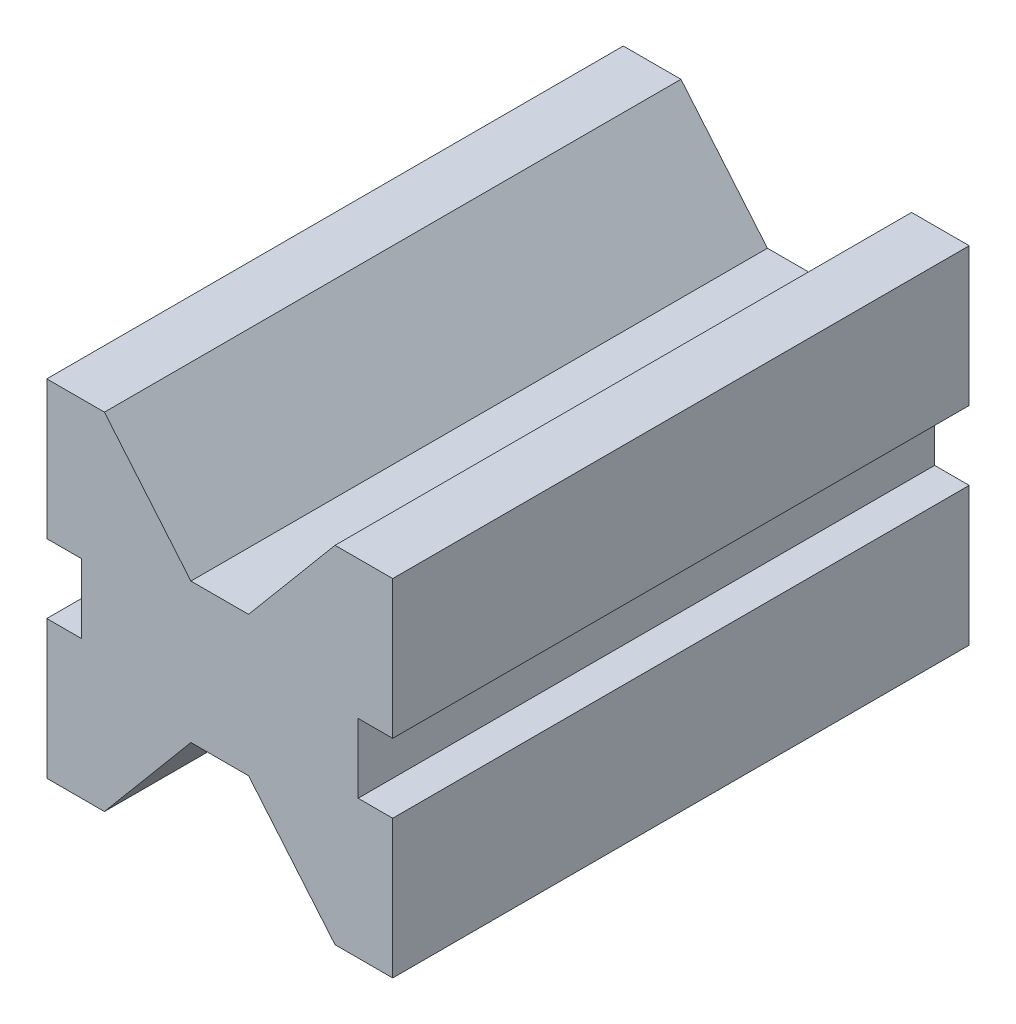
ISO-10303-21;
HEADER;
FILE_DESCRIPTION(('STEP AP214'),'2;1');
FILE_NAME('part.step','',(''),(''),'','','');
FILE_SCHEMA(('AUTOMOTIVE_DESIGN { 1 0 10303 214 1 1 1 1 }'));
ENDSEC;
DATA;
#1=APPLICATION_CONTEXT('core data for automotive mechanical design processes');
#2=APPLICATION_PROTOCOL_DEFINITION('international standard','automotive_design',2000,#1);
#3=PRODUCT_CONTEXT('',#1,'mechanical');
#4=PRODUCT('Part','Part','',(#3));
#5=PRODUCT_RELATED_PRODUCT_CATEGORY('part','',(#4));
#6=PRODUCT_DEFINITION_FORMATION('','',#4);
#7=PRODUCT_DEFINITION_CONTEXT('part definition',#1,'design');
#8=PRODUCT_DEFINITION('design','',#6,#7);
#9=PRODUCT_DEFINITION_SHAPE('','',#8);
#10=(LENGTH_UNIT() NAMED_UNIT(*) SI_UNIT(.MILLI.,.METRE.));
#11=(NAMED_UNIT(*) PLANE_ANGLE_UNIT() SI_UNIT($,.RADIAN.));
#12=(NAMED_UNIT(*) SI_UNIT($,.STERADIAN.) SOLID_ANGLE_UNIT());
#13=UNCERTAINTY_MEASURE_WITH_UNIT(LENGTH_MEASURE(1.E-05),#10,'distance_accuracy_value','');
#14=(GEOMETRIC_REPRESENTATION_CONTEXT(3) GLOBAL_UNCERTAINTY_ASSIGNED_CONTEXT((#13)) GLOBAL_UNIT_ASSIGNED_CONTEXT((#10,
#11,#12)) REPRESENTATION_CONTEXT('',''));
#15=CARTESIAN_POINT('',(0.,0.,0.));
#16=DIRECTION('',(0.,0.,1.));
#17=DIRECTION('',(1.,0.,0.));
#18=AXIS2_PLACEMENT_3D('',#15,#16,#17);
#19=CARTESIAN_POINT('',(-60.,0.,-100.));
#20=DIRECTION('',(-1.,0.,0.));
#21=DIRECTION('',(0.,0.,1.));
#22=AXIS2_PLACEMENT_3D('',#19,#20,#21);
#23=PLANE('',#22);
#24=DIRECTION('',(0.,0.,1.));
#25=VECTOR('',#24,1.);
#26=CARTESIAN_POINT('',(-60.,36.,-143.812809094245));
#27=LINE('',#26,#25);
#28=CARTESIAN_POINT('',(-60.,36.,-100.));
#29=VERTEX_POINT('',#28);
#30=CARTESIAN_POINT('',(-60.,36.,0.));
#31=VERTEX_POINT('',#30);
#32=EDGE_CURVE('E175',#29,#31,#27,.T.);
#33=ORIENTED_EDGE('',*,*,#32,.T.);
#34=DIRECTION('',(0.,-1.,0.));
#35=VECTOR('',#34,1.);
#36=CARTESIAN_POINT('',(-60.,0.,0.));
#37=LINE('',#36,#35);
#38=CARTESIAN_POINT('',(-60.,60.,0.));
#39=VERTEX_POINT('',#38);
#40=EDGE_CURVE('E189',#39,#31,#37,.T.);
#41=ORIENTED_EDGE('',*,*,#40,.F.);
#42=DIRECTION('',(0.,0.,1.));
#43=VECTOR('',#42,1.);
#44=CARTESIAN_POINT('',(-60.,60.,-100.));
#45=LINE('',#44,#43);
#46=CARTESIAN_POINT('',(-60.,60.,-100.));
#47=VERTEX_POINT('',#46);
#48=EDGE_CURVE('E211',#47,#39,#45,.T.);
#49=ORIENTED_EDGE('',*,*,#48,.F.);
#50=DIRECTION('',(0.,-1.,0.));
#51=VECTOR('',#50,1.);
#52=CARTESIAN_POINT('',(-60.,0.,-100.));
#53=LINE('',#52,#51);
#54=EDGE_CURVE('E191',#47,#29,#53,.T.);
#55=ORIENTED_EDGE('',*,*,#54,.T.);
#56=EDGE_LOOP('',(#33,#41,#49,#55));
#57=FACE_BOUND('',#56,.T.);
#58=ADVANCED_FACE('F32',(#57),#23,.T.);
#59=CARTESIAN_POINT('',(0.,0.,-100.));
#60=DIRECTION('',(1.,0.,0.));
#61=DIRECTION('',(0.,0.,-1.));
#62=AXIS2_PLACEMENT_3D('',#59,#60,#61);
#63=PLANE('',#62);
#64=DIRECTION('',(0.,0.,1.));
#65=VECTOR('',#64,1.);
#66=CARTESIAN_POINT('',(0.,24.,-143.812809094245));
#67=LINE('',#66,#65);
#68=CARTESIAN_POINT('',(0.,24.,-100.));
#69=VERTEX_POINT('',#68);
#70=CARTESIAN_POINT('',(0.,24.,0.));
#71=VERTEX_POINT('',#70);
#72=EDGE_CURVE('E294',#69,#71,#67,.T.);
#73=ORIENTED_EDGE('',*,*,#72,.T.);
#74=DIRECTION('',(0.,1.,0.));
#75=VECTOR('',#74,1.);
#76=CARTESIAN_POINT('',(0.,0.,0.));
#77=LINE('',#76,#75);
#78=CARTESIAN_POINT('',(0.,0.,0.));
#79=VERTEX_POINT('',#78);
#80=EDGE_CURVE('E228',#79,#71,#77,.T.);
#81=ORIENTED_EDGE('',*,*,#80,.F.);
#82=DIRECTION('',(0.,0.,1.));
#83=VECTOR('',#82,1.);
#84=CARTESIAN_POINT('',(0.,0.,-100.));
#85=LINE('',#84,#83);
#86=CARTESIAN_POINT('',(0.,0.,-100.));
#87=VERTEX_POINT('',#86);
#88=EDGE_CURVE('E11',#87,#79,#85,.T.);
#89=ORIENTED_EDGE('',*,*,#88,.F.);
#90=DIRECTION('',(0.,1.,0.));
#91=VECTOR('',#90,1.);
#92=CARTESIAN_POINT('',(0.,0.,-100.));
#93=LINE('',#92,#91);
#94=EDGE_CURVE('E248',#87,#69,#93,.T.);
#95=ORIENTED_EDGE('',*,*,#94,.T.);
#96=EDGE_LOOP('',(#73,#81,#89,#95));
#97=FACE_BOUND('',#96,.T.);
#98=ADVANCED_FACE('F356',(#97),#63,.T.);
#99=CARTESIAN_POINT('',(0.,60.,-100.));
#100=DIRECTION('',(0.,1.,0.));
#101=DIRECTION('',(-1.,0.,0.));
#102=AXIS2_PLACEMENT_3D('',#99,#100,#101);
#103=PLANE('',#102);
#104=DIRECTION('',(0.,0.,1.));
#105=VECTOR('',#104,1.);
#106=CARTESIAN_POINT('',(-10.,60.,-143.812809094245));
#107=LINE('',#106,#105);
#108=CARTESIAN_POINT('',(-9.99999999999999,60.,-100.));
#109=VERTEX_POINT('',#108);
#110=CARTESIAN_POINT('',(-10.,60.,0.));
#111=VERTEX_POINT('',#110);
#112=EDGE_CURVE('E316',#109,#111,#107,.T.);
#113=ORIENTED_EDGE('',*,*,#112,.T.);
#114=DIRECTION('',(-1.,0.,0.));
#115=VECTOR('',#114,1.);
#116=CARTESIAN_POINT('',(0.,60.,0.));
#117=LINE('',#116,#115);
#118=CARTESIAN_POINT('',(0.,60.,0.));
#119=VERTEX_POINT('',#118);
#120=EDGE_CURVE('E204',#119,#111,#117,.T.);
#121=ORIENTED_EDGE('',*,*,#120,.F.);
#122=DIRECTION('',(0.,0.,1.));
#123=VECTOR('',#122,1.);
#124=CARTESIAN_POINT('',(0.,60.,-100.));
#125=LINE('',#124,#123);
#126=CARTESIAN_POINT('',(0.,60.,-100.));
#127=VERTEX_POINT('',#126);
#128=EDGE_CURVE('E36',#127,#119,#125,.T.);
#129=ORIENTED_EDGE('',*,*,#128,.F.);
#130=DIRECTION('',(-1.,0.,0.));
#131=VECTOR('',#130,1.);
#132=CARTESIAN_POINT('',(0.,60.,-100.));
#133=LINE('',#132,#131);
#134=EDGE_CURVE('E251',#127,#109,#133,.T.);
#135=ORIENTED_EDGE('',*,*,#134,.T.);
#136=EDGE_LOOP('',(#113,#121,#129,#135));
#137=FACE_BOUND('',#136,.T.);
#138=ADVANCED_FACE('F379',(#137),#103,.T.);
#139=CARTESIAN_POINT('',(0.,0.,-100.));
#140=DIRECTION('',(0.,-1.,0.));
#141=DIRECTION('',(1.,0.,0.));
#142=AXIS2_PLACEMENT_3D('',#139,#140,#141);
#143=PLANE('',#142);
#144=DIRECTION('',(0.,0.,1.));
#145=VECTOR('',#144,1.);
#146=CARTESIAN_POINT('',(-10.,0.,-143.812809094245));
#147=LINE('',#146,#145);
#148=CARTESIAN_POINT('',(-9.99999999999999,0.,-100.));
#149=VERTEX_POINT('',#148);
#150=CARTESIAN_POINT('',(-10.,0.,0.));
#151=VERTEX_POINT('',#150);
#152=EDGE_CURVE('E322',#149,#151,#147,.T.);
#153=ORIENTED_EDGE('',*,*,#152,.F.);
#154=DIRECTION('',(1.,0.,0.));
#155=VECTOR('',#154,1.);
#156=CARTESIAN_POINT('',(0.,0.,-100.));
#157=LINE('',#156,#155);
#158=EDGE_CURVE('E220',#149,#87,#157,.T.);
#159=ORIENTED_EDGE('',*,*,#158,.T.);
#160=ORIENTED_EDGE('',*,*,#88,.T.);
#161=DIRECTION('',(1.,0.,0.));
#162=VECTOR('',#161,1.);
#163=CARTESIAN_POINT('',(0.,0.,0.));
#164=LINE('',#163,#162);
#165=EDGE_CURVE('E199',#151,#79,#164,.T.);
#166=ORIENTED_EDGE('',*,*,#165,.F.);
#167=EDGE_LOOP('',(#153,#159,#160,#166));
#168=FACE_BOUND('',#167,.T.);
#169=ADVANCED_FACE('F353',(#168),#143,.T.);
#170=DIRECTION('',(0.,0.,1.));
#171=VECTOR('',#170,1.);
#172=CARTESIAN_POINT('',(0.,36.,-143.812809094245));
#173=LINE('',#172,#171);
#174=CARTESIAN_POINT('',(0.,36.,-100.));
#175=VERTEX_POINT('',#174);
#176=CARTESIAN_POINT('',(0.,36.,0.));
#177=VERTEX_POINT('',#176);
#178=EDGE_CURVE('E57',#175,#177,#173,.T.);
#179=ORIENTED_EDGE('',*,*,#178,.F.);
#180=EDGE_CURVE('E208',#175,#127,#93,.T.);
#181=ORIENTED_EDGE('',*,*,#180,.T.);
#182=ORIENTED_EDGE('',*,*,#128,.T.);
#183=EDGE_CURVE('E230',#177,#119,#77,.T.);
#184=ORIENTED_EDGE('',*,*,#183,.F.);
#185=EDGE_LOOP('',(#179,#181,#182,#184));
#186=FACE_BOUND('',#185,.T.);
#187=ADVANCED_FACE('F34',(#186),#63,.T.);
#188=DIRECTION('',(0.,0.,1.));
#189=VECTOR('',#188,1.);
#190=CARTESIAN_POINT('',(-50.,0.,-143.812809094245));
#191=LINE('',#190,#189);
#192=CARTESIAN_POINT('',(-50.,0.,-100.));
#193=VERTEX_POINT('',#192);
#194=CARTESIAN_POINT('',(-50.,0.,0.));
#195=VERTEX_POINT('',#194);
#196=EDGE_CURVE('E331',#193,#195,#191,.T.);
#197=ORIENTED_EDGE('',*,*,#196,.T.);
#198=CARTESIAN_POINT('',(-60.,0.,0.));
#199=VERTEX_POINT('',#198);
#200=EDGE_CURVE('E202',#199,#195,#164,.T.);
#201=ORIENTED_EDGE('',*,*,#200,.F.);
#202=DIRECTION('',(0.,0.,1.));
#203=VECTOR('',#202,1.);
#204=CARTESIAN_POINT('',(-60.,0.,-100.));
#205=LINE('',#204,#203);
#206=CARTESIAN_POINT('',(-60.,0.,-100.));
#207=VERTEX_POINT('',#206);
#208=EDGE_CURVE('E41',#207,#199,#205,.T.);
#209=ORIENTED_EDGE('',*,*,#208,.F.);
#210=EDGE_CURVE('E214',#207,#193,#157,.T.);
#211=ORIENTED_EDGE('',*,*,#210,.T.);
#212=EDGE_LOOP('',(#197,#201,#209,#211));
#213=FACE_BOUND('',#212,.T.);
#214=ADVANCED_FACE('F344',(#213),#143,.T.);
#215=DIRECTION('',(0.,0.,1.));
#216=VECTOR('',#215,1.);
#217=CARTESIAN_POINT('',(-60.,24.,-143.812809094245));
#218=LINE('',#217,#216);
#219=CARTESIAN_POINT('',(-60.,24.,-100.));
#220=VERTEX_POINT('',#219);
#221=CARTESIAN_POINT('',(-60.,24.,0.));
#222=VERTEX_POINT('',#221);
#223=EDGE_CURVE('E49',#220,#222,#218,.T.);
#224=ORIENTED_EDGE('',*,*,#223,.F.);
#225=EDGE_CURVE('E253',#220,#207,#53,.T.);
#226=ORIENTED_EDGE('',*,*,#225,.T.);
#227=ORIENTED_EDGE('',*,*,#208,.T.);
#228=EDGE_CURVE('E200',#222,#199,#37,.T.);
#229=ORIENTED_EDGE('',*,*,#228,.F.);
#230=EDGE_LOOP('',(#224,#226,#227,#229));
#231=FACE_BOUND('',#230,.T.);
#232=ADVANCED_FACE('F388',(#231),#23,.T.);
#233=DIRECTION('',(0.,0.,1.));
#234=VECTOR('',#233,1.);
#235=CARTESIAN_POINT('',(-50.,60.,-143.812809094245));
#236=LINE('',#235,#234);
#237=CARTESIAN_POINT('',(-50.,60.,-100.));
#238=VERTEX_POINT('',#237);
#239=CARTESIAN_POINT('',(-50.,60.,0.));
#240=VERTEX_POINT('',#239);
#241=EDGE_CURVE('E260',#238,#240,#236,.T.);
#242=ORIENTED_EDGE('',*,*,#241,.F.);
#243=EDGE_CURVE('E250',#238,#47,#133,.T.);
#244=ORIENTED_EDGE('',*,*,#243,.T.);
#245=ORIENTED_EDGE('',*,*,#48,.T.);
#246=EDGE_CURVE('E197',#240,#39,#117,.T.);
#247=ORIENTED_EDGE('',*,*,#246,.F.);
#248=EDGE_LOOP('',(#242,#244,#245,#247));
#249=FACE_BOUND('',#248,.T.);
#250=ADVANCED_FACE('F259',(#249),#103,.T.);
#251=CARTESIAN_POINT('',(0.,60.,-100.));
#252=DIRECTION('',(0.,0.,1.));
#253=DIRECTION('',(1.,0.,0.));
#254=AXIS2_PLACEMENT_3D('',#251,#252,#253);
#255=PLANE('',#254);
#256=DIRECTION('',(0.,-1.,0.));
#257=VECTOR('',#256,1.);
#258=CARTESIAN_POINT('',(-54.,24.,-100.));
#259=LINE('',#258,#257);
#260=CARTESIAN_POINT('',(-54.,36.,-100.));
#261=VERTEX_POINT('',#260);
#262=CARTESIAN_POINT('',(-54.,24.,-100.));
#263=VERTEX_POINT('',#262);
#264=EDGE_CURVE('E267',#261,#263,#259,.T.);
#265=ORIENTED_EDGE('',*,*,#264,.F.);
#266=DIRECTION('',(1.,0.,0.));
#267=VECTOR('',#266,1.);
#268=CARTESIAN_POINT('',(-60.,36.,-100.));
#269=LINE('',#268,#267);
#270=EDGE_CURVE('E265',#29,#261,#269,.T.);
#271=ORIENTED_EDGE('',*,*,#270,.F.);
#272=ORIENTED_EDGE('',*,*,#54,.F.);
#273=ORIENTED_EDGE('',*,*,#243,.F.);
#274=DIRECTION('',(-0.642787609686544,0.766044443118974,0.));
#275=VECTOR('',#274,1.);
#276=CARTESIAN_POINT('',(-50.,60.,-100.));
#277=LINE('',#276,#275);
#278=CARTESIAN_POINT('',(-35.,42.123696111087,-100.));
#279=VERTEX_POINT('',#278);
#280=EDGE_CURVE('E301',#279,#238,#277,.T.);
#281=ORIENTED_EDGE('',*,*,#280,.F.);
#282=DIRECTION('',(-1.,0.,0.));
#283=VECTOR('',#282,1.);
#284=CARTESIAN_POINT('',(-35.,42.123696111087,-100.));
#285=LINE('',#284,#283);
#286=CARTESIAN_POINT('',(-25.,42.123696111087,-100.));
#287=VERTEX_POINT('',#286);
#288=EDGE_CURVE('E303',#287,#279,#285,.T.);
#289=ORIENTED_EDGE('',*,*,#288,.F.);
#290=DIRECTION('',(-0.642787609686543,-0.766044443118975,0.));
#291=VECTOR('',#290,1.);
#292=CARTESIAN_POINT('',(-10.,60.,-100.));
#293=LINE('',#292,#291);
#294=EDGE_CURVE('E306',#109,#287,#293,.T.);
#295=ORIENTED_EDGE('',*,*,#294,.F.);
#296=ORIENTED_EDGE('',*,*,#134,.F.);
#297=ORIENTED_EDGE('',*,*,#180,.F.);
#298=DIRECTION('',(1.,0.,0.));
#299=VECTOR('',#298,1.);
#300=CARTESIAN_POINT('',(0.,36.,-100.));
#301=LINE('',#300,#299);
#302=CARTESIAN_POINT('',(-6.,36.,-100.));
#303=VERTEX_POINT('',#302);
#304=EDGE_CURVE('E282',#303,#175,#301,.T.);
#305=ORIENTED_EDGE('',*,*,#304,.F.);
#306=DIRECTION('',(0.,1.,0.));
#307=VECTOR('',#306,1.);
#308=CARTESIAN_POINT('',(-6.,24.,-100.));
#309=LINE('',#308,#307);
#310=CARTESIAN_POINT('',(-6.,24.,-100.));
#311=VERTEX_POINT('',#310);
#312=EDGE_CURVE('E284',#311,#303,#309,.T.);
#313=ORIENTED_EDGE('',*,*,#312,.F.);
#314=DIRECTION('',(-1.,0.,0.));
#315=VECTOR('',#314,1.);
#316=CARTESIAN_POINT('',(0.,24.,-100.));
#317=LINE('',#316,#315);
#318=EDGE_CURVE('E287',#69,#311,#317,.T.);
#319=ORIENTED_EDGE('',*,*,#318,.F.);
#320=ORIENTED_EDGE('',*,*,#94,.F.);
#321=ORIENTED_EDGE('',*,*,#158,.F.);
#322=DIRECTION('',(0.642787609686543,-0.766044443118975,0.));
#323=VECTOR('',#322,1.);
#324=CARTESIAN_POINT('',(-10.,0.,-100.));
#325=LINE('',#324,#323);
#326=CARTESIAN_POINT('',(-25.,17.876303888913,-100.));
#327=VERTEX_POINT('',#326);
#328=EDGE_CURVE('E235',#327,#149,#325,.T.);
#329=ORIENTED_EDGE('',*,*,#328,.F.);
#330=DIRECTION('',(1.,0.,0.));
#331=VECTOR('',#330,1.);
#332=CARTESIAN_POINT('',(-35.,17.876303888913,-100.));
#333=LINE('',#332,#331);
#334=CARTESIAN_POINT('',(-35.,17.876303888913,-100.));
#335=VERTEX_POINT('',#334);
#336=EDGE_CURVE('E233',#335,#327,#333,.T.);
#337=ORIENTED_EDGE('',*,*,#336,.F.);
#338=DIRECTION('',(0.642787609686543,0.766044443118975,0.));
#339=VECTOR('',#338,1.);
#340=CARTESIAN_POINT('',(-50.,0.,-100.));
#341=LINE('',#340,#339);
#342=EDGE_CURVE('E242',#193,#335,#341,.T.);
#343=ORIENTED_EDGE('',*,*,#342,.F.);
#344=ORIENTED_EDGE('',*,*,#210,.F.);
#345=ORIENTED_EDGE('',*,*,#225,.F.);
#346=DIRECTION('',(-1.,0.,0.));
#347=VECTOR('',#346,1.);
#348=CARTESIAN_POINT('',(-60.,24.,-100.));
#349=LINE('',#348,#347);
#350=EDGE_CURVE('E272',#263,#220,#349,.T.);
#351=ORIENTED_EDGE('',*,*,#350,.F.);
#352=EDGE_LOOP('',(#265,#271,#272,#273,#281,#289,#295,#296,#297,#305,#313,#319,#320,#321,#329,
#337,#343,#344,#345,#351));
#353=FACE_BOUND('',#352,.T.);
#354=ADVANCED_FACE('F264',(#353),#255,.F.);
#355=CARTESIAN_POINT('',(0.,60.,0.));
#356=DIRECTION('',(0.,0.,1.));
#357=DIRECTION('',(1.,0.,0.));
#358=AXIS2_PLACEMENT_3D('',#355,#356,#357);
#359=PLANE('',#358);
#360=DIRECTION('',(-1.,0.,0.));
#361=VECTOR('',#360,1.);
#362=CARTESIAN_POINT('',(-60.,36.,0.));
#363=LINE('',#362,#361);
#364=CARTESIAN_POINT('',(-54.,36.,0.));
#365=VERTEX_POINT('',#364);
#366=EDGE_CURVE('E172',#365,#31,#363,.T.);
#367=ORIENTED_EDGE('',*,*,#366,.F.);
#368=DIRECTION('',(0.,1.,0.));
#369=VECTOR('',#368,1.);
#370=CARTESIAN_POINT('',(-54.,24.,0.));
#371=LINE('',#370,#369);
#372=CARTESIAN_POINT('',(-54.,24.,0.));
#373=VERTEX_POINT('',#372);
#374=EDGE_CURVE('E192',#373,#365,#371,.T.);
#375=ORIENTED_EDGE('',*,*,#374,.F.);
#376=DIRECTION('',(1.,0.,0.));
#377=VECTOR('',#376,1.);
#378=CARTESIAN_POINT('',(-60.,24.,0.));
#379=LINE('',#378,#377);
#380=EDGE_CURVE('E183',#222,#373,#379,.T.);
#381=ORIENTED_EDGE('',*,*,#380,.F.);
#382=ORIENTED_EDGE('',*,*,#228,.T.);
#383=ORIENTED_EDGE('',*,*,#200,.T.);
#384=DIRECTION('',(-0.642787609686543,-0.766044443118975,0.));
#385=VECTOR('',#384,1.);
#386=CARTESIAN_POINT('',(-50.,0.,0.));
#387=LINE('',#386,#385);
#388=CARTESIAN_POINT('',(-35.,17.876303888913,0.));
#389=VERTEX_POINT('',#388);
#390=EDGE_CURVE('E328',#389,#195,#387,.T.);
#391=ORIENTED_EDGE('',*,*,#390,.F.);
#392=DIRECTION('',(-1.,0.,0.));
#393=VECTOR('',#392,1.);
#394=CARTESIAN_POINT('',(-35.,17.876303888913,0.));
#395=LINE('',#394,#393);
#396=CARTESIAN_POINT('',(-25.,17.876303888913,0.));
#397=VERTEX_POINT('',#396);
#398=EDGE_CURVE('E325',#397,#389,#395,.T.);
#399=ORIENTED_EDGE('',*,*,#398,.F.);
#400=DIRECTION('',(-0.642787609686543,0.766044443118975,0.));
#401=VECTOR('',#400,1.);
#402=CARTESIAN_POINT('',(-10.,0.,0.));
#403=LINE('',#402,#401);
#404=EDGE_CURVE('E308',#151,#397,#403,.T.);
#405=ORIENTED_EDGE('',*,*,#404,.F.);
#406=ORIENTED_EDGE('',*,*,#165,.T.);
#407=ORIENTED_EDGE('',*,*,#80,.T.);
#408=DIRECTION('',(1.,0.,0.));
#409=VECTOR('',#408,1.);
#410=CARTESIAN_POINT('',(0.,24.,0.));
#411=LINE('',#410,#409);
#412=CARTESIAN_POINT('',(-6.,24.,0.));
#413=VERTEX_POINT('',#412);
#414=EDGE_CURVE('E268',#413,#71,#411,.T.);
#415=ORIENTED_EDGE('',*,*,#414,.F.);
#416=DIRECTION('',(0.,-1.,0.));
#417=VECTOR('',#416,1.);
#418=CARTESIAN_POINT('',(-6.,24.,0.));
#419=LINE('',#418,#417);
#420=CARTESIAN_POINT('',(-6.,36.,0.));
#421=VERTEX_POINT('',#420);
#422=EDGE_CURVE('E291',#421,#413,#419,.T.);
#423=ORIENTED_EDGE('',*,*,#422,.F.);
#424=DIRECTION('',(-1.,0.,0.));
#425=VECTOR('',#424,1.);
#426=CARTESIAN_POINT('',(0.,36.,0.));
#427=LINE('',#426,#425);
#428=EDGE_CURVE('E270',#177,#421,#427,.T.);
#429=ORIENTED_EDGE('',*,*,#428,.F.);
#430=ORIENTED_EDGE('',*,*,#183,.T.);
#431=ORIENTED_EDGE('',*,*,#120,.T.);
#432=DIRECTION('',(0.642787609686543,0.766044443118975,0.));
#433=VECTOR('',#432,1.);
#434=CARTESIAN_POINT('',(-10.,60.,0.));
#435=LINE('',#434,#433);
#436=CARTESIAN_POINT('',(-25.,42.123696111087,0.));
#437=VERTEX_POINT('',#436);
#438=EDGE_CURVE('E288',#437,#111,#435,.T.);
#439=ORIENTED_EDGE('',*,*,#438,.F.);
#440=DIRECTION('',(1.,0.,0.));
#441=VECTOR('',#440,1.);
#442=CARTESIAN_POINT('',(-35.,42.123696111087,0.));
#443=LINE('',#442,#441);
#444=CARTESIAN_POINT('',(-35.,42.123696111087,0.));
#445=VERTEX_POINT('',#444);
#446=EDGE_CURVE('E313',#445,#437,#443,.T.);
#447=ORIENTED_EDGE('',*,*,#446,.F.);
#448=DIRECTION('',(0.642787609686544,-0.766044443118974,0.));
#449=VECTOR('',#448,1.);
#450=CARTESIAN_POINT('',(-50.,60.,0.));
#451=LINE('',#450,#449);
#452=EDGE_CURVE('E310',#240,#445,#451,.T.);
#453=ORIENTED_EDGE('',*,*,#452,.F.);
#454=ORIENTED_EDGE('',*,*,#246,.T.);
#455=ORIENTED_EDGE('',*,*,#40,.T.);
#456=EDGE_LOOP('',(#367,#375,#381,#382,#383,#391,#399,#405,#406,#407,#415,#423,#429,#430,#431,
#439,#447,#453,#454,#455));
#457=FACE_BOUND('',#456,.T.);
#458=ADVANCED_FACE('F194',(#457),#359,.T.);
#459=CARTESIAN_POINT('',(-10.,0.,-143.812809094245));
#460=DIRECTION('',(0.766044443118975,0.642787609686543,0.));
#461=DIRECTION('',(-0.642787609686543,0.766044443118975,0.));
#462=AXIS2_PLACEMENT_3D('',#459,#460,#461);
#463=PLANE('',#462);
#464=ORIENTED_EDGE('',*,*,#328,.T.);
#465=ORIENTED_EDGE('',*,*,#152,.T.);
#466=ORIENTED_EDGE('',*,*,#404,.T.);
#467=DIRECTION('',(0.,0.,1.));
#468=VECTOR('',#467,1.);
#469=CARTESIAN_POINT('',(-25.,17.876303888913,-143.812809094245));
#470=LINE('',#469,#468);
#471=EDGE_CURVE('E246',#327,#397,#470,.T.);
#472=ORIENTED_EDGE('',*,*,#471,.F.);
#473=EDGE_LOOP('',(#464,#465,#466,#472));
#474=FACE_BOUND('',#473,.T.);
#475=ADVANCED_FACE('F351',(#474),#463,.F.);
#476=CARTESIAN_POINT('',(-50.,0.,-143.812809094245));
#477=DIRECTION('',(-0.766044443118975,0.642787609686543,0.));
#478=DIRECTION('',(-0.642787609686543,-0.766044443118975,0.));
#479=AXIS2_PLACEMENT_3D('',#476,#477,#478);
#480=PLANE('',#479);
#481=ORIENTED_EDGE('',*,*,#342,.T.);
#482=DIRECTION('',(0.,0.,1.));
#483=VECTOR('',#482,1.);
#484=CARTESIAN_POINT('',(-35.,17.876303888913,-143.812809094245));
#485=LINE('',#484,#483);
#486=EDGE_CURVE('E332',#335,#389,#485,.T.);
#487=ORIENTED_EDGE('',*,*,#486,.T.);
#488=ORIENTED_EDGE('',*,*,#390,.T.);
#489=ORIENTED_EDGE('',*,*,#196,.F.);
#490=EDGE_LOOP('',(#481,#487,#488,#489));
#491=FACE_BOUND('',#490,.T.);
#492=ADVANCED_FACE('F342',(#491),#480,.F.);
#493=CARTESIAN_POINT('',(-35.,17.876303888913,-143.812809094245));
#494=DIRECTION('',(0.,1.,0.));
#495=DIRECTION('',(0.,0.,1.));
#496=AXIS2_PLACEMENT_3D('',#493,#494,#495);
#497=PLANE('',#496);
#498=ORIENTED_EDGE('',*,*,#336,.T.);
#499=ORIENTED_EDGE('',*,*,#471,.T.);
#500=ORIENTED_EDGE('',*,*,#398,.T.);
#501=ORIENTED_EDGE('',*,*,#486,.F.);
#502=EDGE_LOOP('',(#498,#499,#500,#501));
#503=FACE_BOUND('',#502,.T.);
#504=ADVANCED_FACE('F335',(#503),#497,.F.);
#505=CARTESIAN_POINT('',(-10.,60.,-143.812809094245));
#506=DIRECTION('',(0.766044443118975,-0.642787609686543,0.));
#507=DIRECTION('',(0.642787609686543,0.766044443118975,0.));
#508=AXIS2_PLACEMENT_3D('',#505,#506,#507);
#509=PLANE('',#508);
#510=ORIENTED_EDGE('',*,*,#294,.T.);
#511=DIRECTION('',(0.,0.,1.));
#512=VECTOR('',#511,1.);
#513=CARTESIAN_POINT('',(-25.,42.123696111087,-143.812809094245));
#514=LINE('',#513,#512);
#515=EDGE_CURVE('E304',#287,#437,#514,.T.);
#516=ORIENTED_EDGE('',*,*,#515,.T.);
#517=ORIENTED_EDGE('',*,*,#438,.T.);
#518=ORIENTED_EDGE('',*,*,#112,.F.);
#519=EDGE_LOOP('',(#510,#516,#517,#518));
#520=FACE_BOUND('',#519,.T.);
#521=ADVANCED_FACE('F373',(#520),#509,.F.);
#522=CARTESIAN_POINT('',(-35.,42.123696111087,-143.812809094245));
#523=DIRECTION('',(0.,-1.,0.));
#524=DIRECTION('',(0.,0.,-1.));
#525=AXIS2_PLACEMENT_3D('',#522,#523,#524);
#526=PLANE('',#525);
#527=ORIENTED_EDGE('',*,*,#288,.T.);
#528=DIRECTION('',(0.,0.,1.));
#529=VECTOR('',#528,1.);
#530=CARTESIAN_POINT('',(-35.,42.123696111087,-143.812809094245));
#531=LINE('',#530,#529);
#532=EDGE_CURVE('E318',#279,#445,#531,.T.);
#533=ORIENTED_EDGE('',*,*,#532,.T.);
#534=ORIENTED_EDGE('',*,*,#446,.T.);
#535=ORIENTED_EDGE('',*,*,#515,.F.);
#536=EDGE_LOOP('',(#527,#533,#534,#535));
#537=FACE_BOUND('',#536,.T.);
#538=ADVANCED_FACE('F375',(#537),#526,.F.);
#539=CARTESIAN_POINT('',(-50.,60.,-143.812809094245));
#540=DIRECTION('',(-0.766044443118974,-0.642787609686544,0.));
#541=DIRECTION('',(0.642787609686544,-0.766044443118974,0.));
#542=AXIS2_PLACEMENT_3D('',#539,#540,#541);
#543=PLANE('',#542);
#544=ORIENTED_EDGE('',*,*,#280,.T.);
#545=ORIENTED_EDGE('',*,*,#241,.T.);
#546=ORIENTED_EDGE('',*,*,#452,.T.);
#547=ORIENTED_EDGE('',*,*,#532,.F.);
#548=EDGE_LOOP('',(#544,#545,#546,#547));
#549=FACE_BOUND('',#548,.T.);
#550=ADVANCED_FACE('F415',(#549),#543,.F.);
#551=CARTESIAN_POINT('',(0.,24.,-143.812809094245));
#552=DIRECTION('',(0.,-1.,0.));
#553=DIRECTION('',(0.,0.,-1.));
#554=AXIS2_PLACEMENT_3D('',#551,#552,#553);
#555=PLANE('',#554);
#556=ORIENTED_EDGE('',*,*,#318,.T.);
#557=DIRECTION('',(0.,0.,1.));
#558=VECTOR('',#557,1.);
#559=CARTESIAN_POINT('',(-6.,24.,-143.812809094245));
#560=LINE('',#559,#558);
#561=EDGE_CURVE('E285',#311,#413,#560,.T.);
#562=ORIENTED_EDGE('',*,*,#561,.T.);
#563=ORIENTED_EDGE('',*,*,#414,.T.);
#564=ORIENTED_EDGE('',*,*,#72,.F.);
#565=EDGE_LOOP('',(#556,#562,#563,#564));
#566=FACE_BOUND('',#565,.T.);
#567=ADVANCED_FACE('F359',(#566),#555,.F.);
#568=CARTESIAN_POINT('',(-6.,24.,-143.812809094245));
#569=DIRECTION('',(-1.,0.,0.));
#570=DIRECTION('',(0.,0.,1.));
#571=AXIS2_PLACEMENT_3D('',#568,#569,#570);
#572=PLANE('',#571);
#573=ORIENTED_EDGE('',*,*,#312,.T.);
#574=DIRECTION('',(0.,0.,1.));
#575=VECTOR('',#574,1.);
#576=CARTESIAN_POINT('',(-6.,36.,-143.812809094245));
#577=LINE('',#576,#575);
#578=EDGE_CURVE('E296',#303,#421,#577,.T.);
#579=ORIENTED_EDGE('',*,*,#578,.T.);
#580=ORIENTED_EDGE('',*,*,#422,.T.);
#581=ORIENTED_EDGE('',*,*,#561,.F.);
#582=EDGE_LOOP('',(#573,#579,#580,#581));
#583=FACE_BOUND('',#582,.T.);
#584=ADVANCED_FACE('F366',(#583),#572,.F.);
#585=CARTESIAN_POINT('',(0.,36.,-143.812809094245));
#586=DIRECTION('',(0.,1.,0.));
#587=DIRECTION('',(0.,0.,1.));
#588=AXIS2_PLACEMENT_3D('',#585,#586,#587);
#589=PLANE('',#588);
#590=ORIENTED_EDGE('',*,*,#304,.T.);
#591=ORIENTED_EDGE('',*,*,#178,.T.);
#592=ORIENTED_EDGE('',*,*,#428,.T.);
#593=ORIENTED_EDGE('',*,*,#578,.F.);
#594=EDGE_LOOP('',(#590,#591,#592,#593));
#595=FACE_BOUND('',#594,.T.);
#596=ADVANCED_FACE('F367',(#595),#589,.F.);
#597=CARTESIAN_POINT('',(-60.,36.,-143.812809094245));
#598=DIRECTION('',(0.,1.,0.));
#599=DIRECTION('',(0.,0.,1.));
#600=AXIS2_PLACEMENT_3D('',#597,#598,#599);
#601=PLANE('',#600);
#602=ORIENTED_EDGE('',*,*,#270,.T.);
#603=DIRECTION('',(0.,0.,1.));
#604=VECTOR('',#603,1.);
#605=CARTESIAN_POINT('',(-54.,36.,-143.812809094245));
#606=LINE('',#605,#604);
#607=EDGE_CURVE('E178',#261,#365,#606,.T.);
#608=ORIENTED_EDGE('',*,*,#607,.T.);
#609=ORIENTED_EDGE('',*,*,#366,.T.);
#610=ORIENTED_EDGE('',*,*,#32,.F.);
#611=EDGE_LOOP('',(#602,#608,#609,#610));
#612=FACE_BOUND('',#611,.T.);
#613=ADVANCED_FACE('F174',(#612),#601,.F.);
#614=CARTESIAN_POINT('',(-54.,24.,-143.812809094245));
#615=DIRECTION('',(1.,0.,0.));
#616=DIRECTION('',(0.,0.,-1.));
#617=AXIS2_PLACEMENT_3D('',#614,#615,#616);
#618=PLANE('',#617);
#619=ORIENTED_EDGE('',*,*,#264,.T.);
#620=DIRECTION('',(0.,0.,1.));
#621=VECTOR('',#620,1.);
#622=CARTESIAN_POINT('',(-54.,24.,-143.812809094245));
#623=LINE('',#622,#621);
#624=EDGE_CURVE('E279',#263,#373,#623,.T.);
#625=ORIENTED_EDGE('',*,*,#624,.T.);
#626=ORIENTED_EDGE('',*,*,#374,.T.);
#627=ORIENTED_EDGE('',*,*,#607,.F.);
#628=EDGE_LOOP('',(#619,#625,#626,#627));
#629=FACE_BOUND('',#628,.T.);
#630=ADVANCED_FACE('F399',(#629),#618,.F.);
#631=CARTESIAN_POINT('',(-60.,24.,-143.812809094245));
#632=DIRECTION('',(0.,-1.,0.));
#633=DIRECTION('',(0.,0.,-1.));
#634=AXIS2_PLACEMENT_3D('',#631,#632,#633);
#635=PLANE('',#634);
#636=ORIENTED_EDGE('',*,*,#350,.T.);
#637=ORIENTED_EDGE('',*,*,#223,.T.);
#638=ORIENTED_EDGE('',*,*,#380,.T.);
#639=ORIENTED_EDGE('',*,*,#624,.F.);
#640=EDGE_LOOP('',(#636,#637,#638,#639));
#641=FACE_BOUND('',#640,.T.);
#642=ADVANCED_FACE('F397',(#641),#635,.F.);
#643=CLOSED_SHELL('',(#58,#98,#138,#169,#187,#214,#232,#250,#354,#458,#475,#492,#504,#521,#538,
#550,#567,#584,#596,#613,#630,#642));
#644=MANIFOLD_SOLID_BREP('B2',#643);
#645=ADVANCED_BREP_SHAPE_REPRESENTATION('',(#18,#644),#14);
#646=SHAPE_DEFINITION_REPRESENTATION(#9,#645);
ENDSEC;
END-ISO-10303-21;
